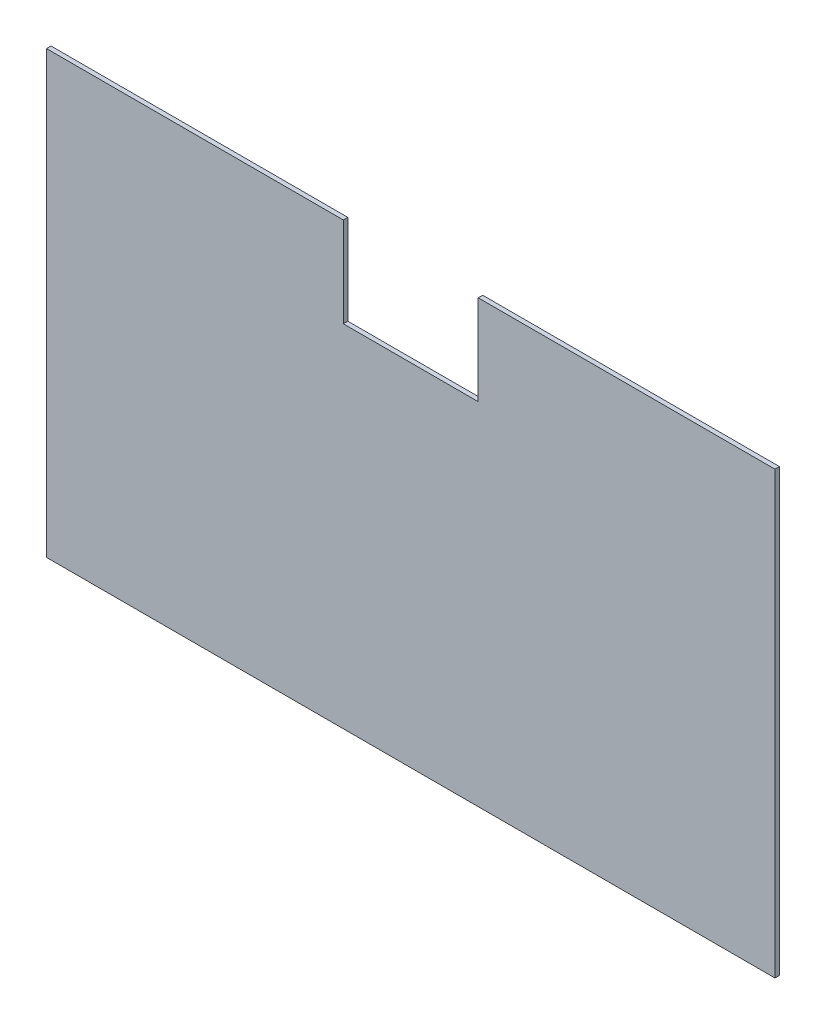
from build123d import *

# Parameters (mm, degrees)
EXTRUDE_1_DEPTH = 1


with BuildPart() as part:
    # Sketch 1 → Extrude 1 (new body)
    with BuildSketch(Plane.XY):
        Polygon((-72.784989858, 24.770654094), (-6.784989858, 24.770654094), (-6.784989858, 4.770654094), (23.215010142, 4.770654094), (23.215010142, 24.770654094), (89.215010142, 24.770654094), (89.215010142, -73.229345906), (-72.784989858, -73.229345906), align=None)
    extrude(amount=EXTRUDE_1_DEPTH)


solid = part.part
